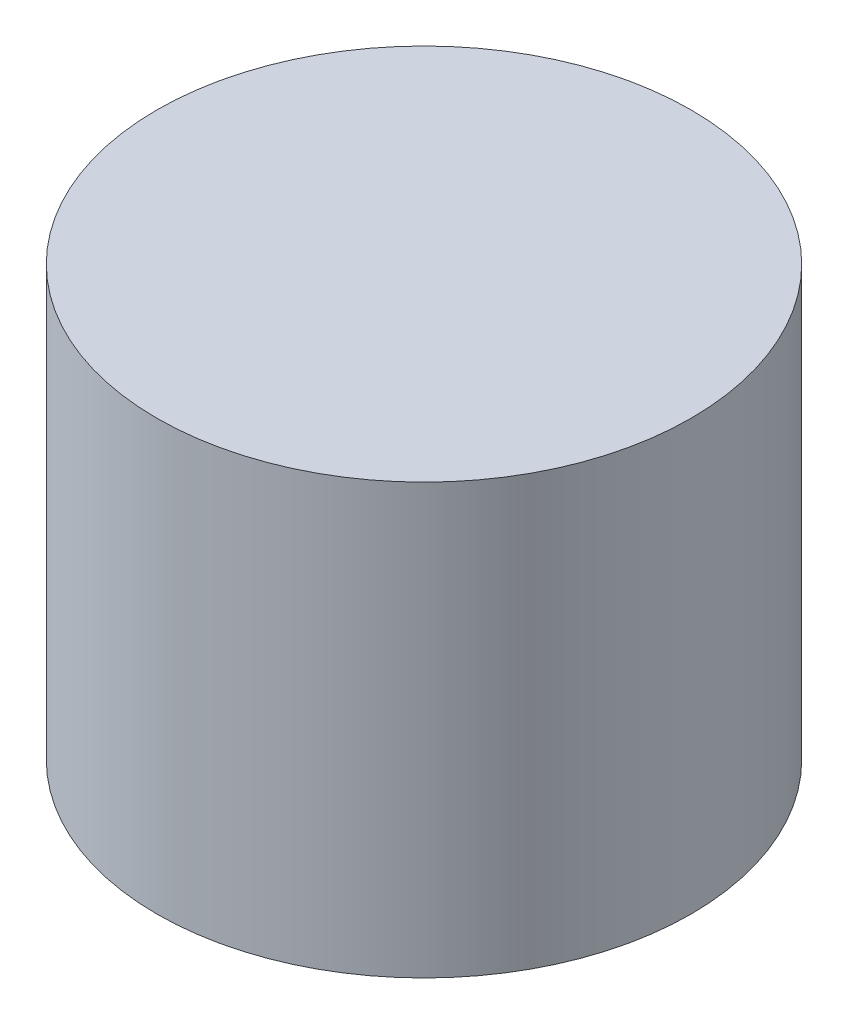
ISO-10303-21;
HEADER;
FILE_DESCRIPTION(('STEP AP214'),'2;1');
FILE_NAME('part.step','',(''),(''),'','','');
FILE_SCHEMA(('AUTOMOTIVE_DESIGN { 1 0 10303 214 1 1 1 1 }'));
ENDSEC;
DATA;
#1=APPLICATION_CONTEXT('core data for automotive mechanical design processes');
#2=APPLICATION_PROTOCOL_DEFINITION('international standard','automotive_design',2000,#1);
#3=PRODUCT_CONTEXT('',#1,'mechanical');
#4=PRODUCT('Part','Part','',(#3));
#5=PRODUCT_RELATED_PRODUCT_CATEGORY('part','',(#4));
#6=PRODUCT_DEFINITION_FORMATION('','',#4);
#7=PRODUCT_DEFINITION_CONTEXT('part definition',#1,'design');
#8=PRODUCT_DEFINITION('design','',#6,#7);
#9=PRODUCT_DEFINITION_SHAPE('','',#8);
#10=(LENGTH_UNIT() NAMED_UNIT(*) SI_UNIT(.MILLI.,.METRE.));
#11=(NAMED_UNIT(*) PLANE_ANGLE_UNIT() SI_UNIT($,.RADIAN.));
#12=(NAMED_UNIT(*) SI_UNIT($,.STERADIAN.) SOLID_ANGLE_UNIT());
#13=UNCERTAINTY_MEASURE_WITH_UNIT(LENGTH_MEASURE(1.E-05),#10,'distance_accuracy_value','');
#14=(GEOMETRIC_REPRESENTATION_CONTEXT(3) GLOBAL_UNCERTAINTY_ASSIGNED_CONTEXT((#13)) GLOBAL_UNIT_ASSIGNED_CONTEXT((#10,
#11,#12)) REPRESENTATION_CONTEXT('',''));
#15=CARTESIAN_POINT('',(0.,0.,0.));
#16=DIRECTION('',(0.,0.,1.));
#17=DIRECTION('',(1.,0.,0.));
#18=AXIS2_PLACEMENT_3D('',#15,#16,#17);
#19=CARTESIAN_POINT('',(0.,20.5,0.));
#20=DIRECTION('',(0.,-1.,0.));
#21=DIRECTION('',(0.,0.,-1.));
#22=AXIS2_PLACEMENT_3D('',#19,#20,#21);
#23=CYLINDRICAL_SURFACE('',#22,12.75);
#24=CARTESIAN_POINT('',(0.,20.5,0.));
#25=DIRECTION('',(0.,1.,0.));
#26=DIRECTION('',(0.,0.,1.));
#27=AXIS2_PLACEMENT_3D('',#24,#25,#26);
#28=CIRCLE('',#27,12.75);
#29=CARTESIAN_POINT('',(0.,20.5,12.75));
#30=VERTEX_POINT('',#29);
#31=EDGE_CURVE('E10',#30,#30,#28,.T.);
#32=ORIENTED_EDGE('',*,*,#31,.F.);
#33=EDGE_LOOP('',(#32));
#34=FACE_BOUND('',#33,.T.);
#35=CARTESIAN_POINT('',(0.,0.,0.));
#36=DIRECTION('',(0.,1.,0.));
#37=DIRECTION('',(0.,0.,1.));
#38=AXIS2_PLACEMENT_3D('',#35,#36,#37);
#39=CIRCLE('',#38,12.75);
#40=CARTESIAN_POINT('',(0.,0.,12.75));
#41=VERTEX_POINT('',#40);
#42=EDGE_CURVE('E46',#41,#41,#39,.T.);
#43=ORIENTED_EDGE('',*,*,#42,.T.);
#44=EDGE_LOOP('',(#43));
#45=FACE_BOUND('',#44,.T.);
#46=ADVANCED_FACE('F43',(#34,#45),#23,.T.);
#47=CARTESIAN_POINT('',(0.,20.5,0.));
#48=DIRECTION('',(0.,1.,0.));
#49=DIRECTION('',(0.,0.,1.));
#50=AXIS2_PLACEMENT_3D('',#47,#48,#49);
#51=PLANE('',#50);
#52=ORIENTED_EDGE('',*,*,#31,.T.);
#53=EDGE_LOOP('',(#52));
#54=FACE_BOUND('',#53,.T.);
#55=ADVANCED_FACE('F60',(#54),#51,.T.);
#56=CARTESIAN_POINT('',(0.,0.,0.));
#57=DIRECTION('',(0.,1.,0.));
#58=DIRECTION('',(0.,0.,1.));
#59=AXIS2_PLACEMENT_3D('',#56,#57,#58);
#60=PLANE('',#59);
#61=ORIENTED_EDGE('',*,*,#42,.F.);
#62=EDGE_LOOP('',(#61));
#63=FACE_BOUND('',#62,.T.);
#64=ADVANCED_FACE('F58',(#63),#60,.F.);
#65=CLOSED_SHELL('',(#46,#55,#64));
#66=MANIFOLD_SOLID_BREP('B2',#65);
#67=ADVANCED_BREP_SHAPE_REPRESENTATION('',(#18,#66),#14);
#68=SHAPE_DEFINITION_REPRESENTATION(#9,#67);
ENDSEC;
END-ISO-10303-21;
